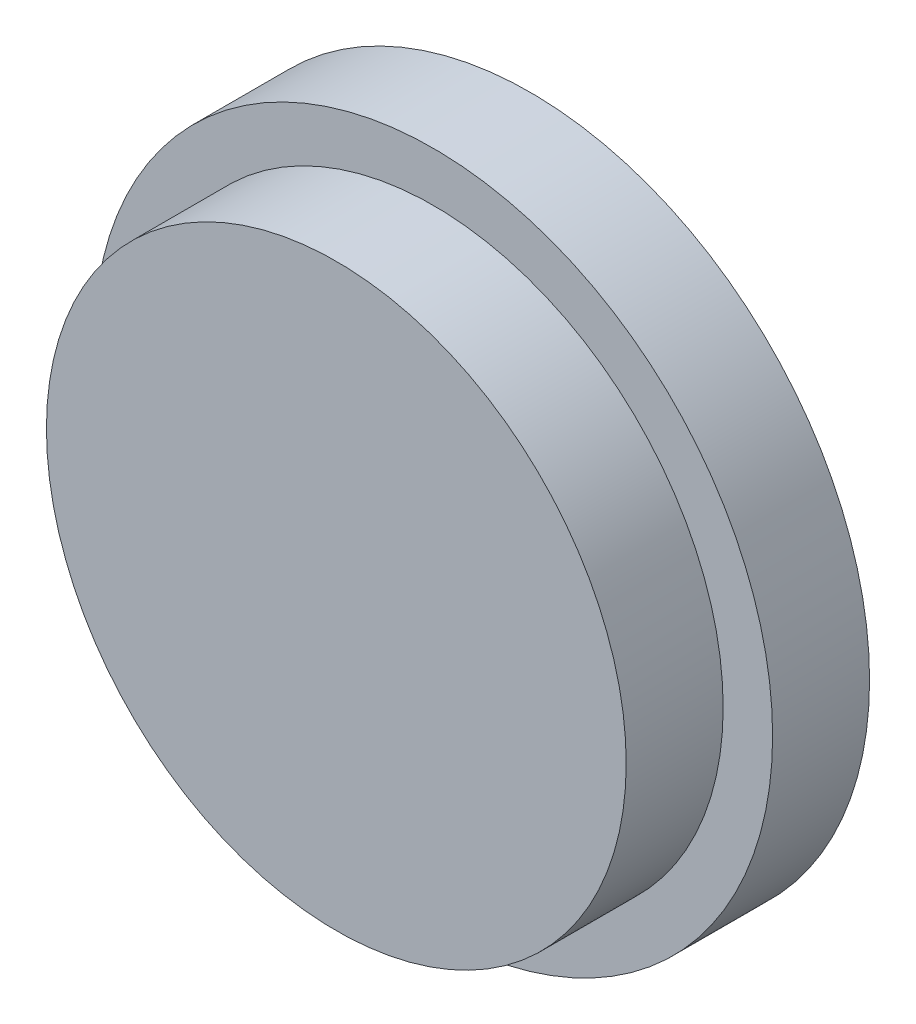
from build123d import *

# Parameters (mm, degrees)
SKETCH1_R           = 44.45
BOSS_EXTRUDE1_DEPTH = 12.7
SKETCH2_R           = 37.973
BOSS_EXTRUDE2_DEPTH = 12.7


with BuildPart() as part:
    # Sketch1 → Boss-Extrude1 (new body)
    with BuildSketch(Plane.XY):
        Circle(SKETCH1_R)
    extrude(amount=BOSS_EXTRUDE1_DEPTH)

    # Sketch2 → Boss-Extrude2 (add)
    with BuildSketch(Plane.XY.offset(12.7)):
        Circle(SKETCH2_R)
    extrude(amount=BOSS_EXTRUDE2_DEPTH)


solid = part.part
